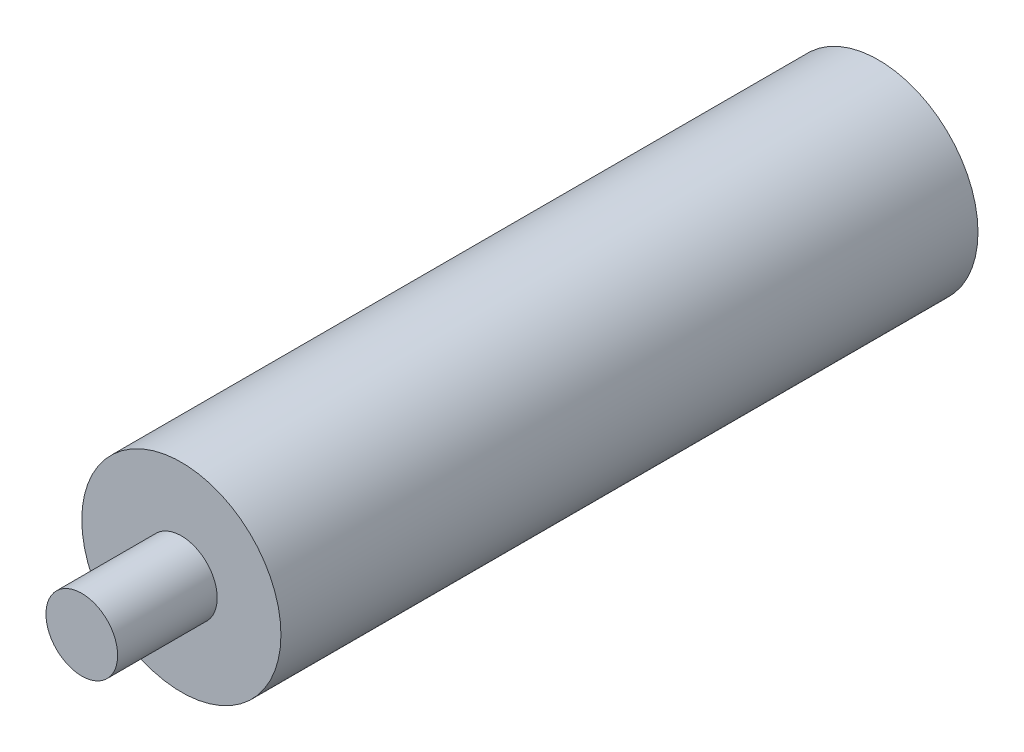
ISO-10303-21;
HEADER;
FILE_DESCRIPTION(('STEP AP214'),'2;1');
FILE_NAME('part.step','',(''),(''),'','','');
FILE_SCHEMA(('AUTOMOTIVE_DESIGN { 1 0 10303 214 1 1 1 1 }'));
ENDSEC;
DATA;
#1=APPLICATION_CONTEXT('core data for automotive mechanical design processes');
#2=APPLICATION_PROTOCOL_DEFINITION('international standard','automotive_design',2000,#1);
#3=PRODUCT_CONTEXT('',#1,'mechanical');
#4=PRODUCT('Part','Part','',(#3));
#5=PRODUCT_RELATED_PRODUCT_CATEGORY('part','',(#4));
#6=PRODUCT_DEFINITION_FORMATION('','',#4);
#7=PRODUCT_DEFINITION_CONTEXT('part definition',#1,'design');
#8=PRODUCT_DEFINITION('design','',#6,#7);
#9=PRODUCT_DEFINITION_SHAPE('','',#8);
#10=(LENGTH_UNIT() NAMED_UNIT(*) SI_UNIT(.MILLI.,.METRE.));
#11=(NAMED_UNIT(*) PLANE_ANGLE_UNIT() SI_UNIT($,.RADIAN.));
#12=(NAMED_UNIT(*) SI_UNIT($,.STERADIAN.) SOLID_ANGLE_UNIT());
#13=UNCERTAINTY_MEASURE_WITH_UNIT(LENGTH_MEASURE(1.E-05),#10,'distance_accuracy_value','');
#14=(GEOMETRIC_REPRESENTATION_CONTEXT(3) GLOBAL_UNCERTAINTY_ASSIGNED_CONTEXT((#13)) GLOBAL_UNIT_ASSIGNED_CONTEXT((#10,
#11,#12)) REPRESENTATION_CONTEXT('',''));
#15=CARTESIAN_POINT('',(0.,0.,0.));
#16=DIRECTION('',(0.,0.,1.));
#17=DIRECTION('',(1.,0.,0.));
#18=AXIS2_PLACEMENT_3D('',#15,#16,#17);
#19=CARTESIAN_POINT('',(0.,0.,25.4));
#20=DIRECTION('',(0.,0.,1.));
#21=DIRECTION('',(1.,0.,0.));
#22=AXIS2_PLACEMENT_3D('',#19,#20,#21);
#23=PLANE('',#22);
#24=CARTESIAN_POINT('',(0.,0.,25.4));
#25=DIRECTION('',(0.,0.,1.));
#26=DIRECTION('',(1.,0.,0.));
#27=AXIS2_PLACEMENT_3D('',#24,#25,#26);
#28=CIRCLE('',#27,1.143);
#29=CARTESIAN_POINT('',(1.143,0.,25.4));
#30=VERTEX_POINT('',#29);
#31=EDGE_CURVE('E18',#30,#30,#28,.F.);
#32=ORIENTED_EDGE('',*,*,#31,.F.);
#33=EDGE_LOOP('',(#32));
#34=FACE_BOUND('',#33,.T.);
#35=ADVANCED_FACE('F15',(#34),#23,.T.);
#36=CARTESIAN_POINT('',(0.,0.,22.225));
#37=DIRECTION('',(0.,0.,1.));
#38=DIRECTION('',(1.,0.,0.));
#39=AXIS2_PLACEMENT_3D('',#36,#37,#38);
#40=CYLINDRICAL_SURFACE('',#39,1.143);
#41=ORIENTED_EDGE('',*,*,#31,.T.);
#42=EDGE_LOOP('',(#41));
#43=FACE_BOUND('',#42,.T.);
#44=CARTESIAN_POINT('',(0.,0.,22.225));
#45=DIRECTION('',(0.,0.,1.));
#46=DIRECTION('',(1.,0.,0.));
#47=AXIS2_PLACEMENT_3D('',#44,#45,#46);
#48=CIRCLE('',#47,1.143);
#49=CARTESIAN_POINT('',(1.143,0.,22.225));
#50=VERTEX_POINT('',#49);
#51=EDGE_CURVE('E27',#50,#50,#48,.F.);
#52=ORIENTED_EDGE('',*,*,#51,.F.);
#53=EDGE_LOOP('',(#52));
#54=FACE_BOUND('',#53,.T.);
#55=ADVANCED_FACE('F35',(#43,#54),#40,.T.);
#56=CARTESIAN_POINT('',(0.,0.,22.225));
#57=DIRECTION('',(0.,0.,1.));
#58=DIRECTION('',(1.,0.,0.));
#59=AXIS2_PLACEMENT_3D('',#56,#57,#58);
#60=PLANE('',#59);
#61=ORIENTED_EDGE('',*,*,#51,.T.);
#62=EDGE_LOOP('',(#61));
#63=FACE_BOUND('',#62,.T.);
#64=CARTESIAN_POINT('',(0.,0.,22.225));
#65=DIRECTION('',(0.,0.,1.));
#66=DIRECTION('',(1.,0.,0.));
#67=AXIS2_PLACEMENT_3D('',#64,#65,#66);
#68=CIRCLE('',#67,3.175);
#69=CARTESIAN_POINT('',(3.175,0.,22.225));
#70=VERTEX_POINT('',#69);
#71=EDGE_CURVE('E22',#70,#70,#68,.F.);
#72=ORIENTED_EDGE('',*,*,#71,.F.);
#73=EDGE_LOOP('',(#72));
#74=FACE_BOUND('',#73,.T.);
#75=ADVANCED_FACE('F43',(#63,#74),#60,.T.);
#76=CARTESIAN_POINT('',(0.,0.,0.));
#77=DIRECTION('',(0.,0.,1.));
#78=DIRECTION('',(1.,0.,0.));
#79=AXIS2_PLACEMENT_3D('',#76,#77,#78);
#80=PLANE('',#79);
#81=CARTESIAN_POINT('',(0.,0.,0.));
#82=DIRECTION('',(0.,0.,1.));
#83=DIRECTION('',(1.,0.,0.));
#84=AXIS2_PLACEMENT_3D('',#81,#82,#83);
#85=CIRCLE('',#84,3.175);
#86=CARTESIAN_POINT('',(3.175,0.,0.));
#87=VERTEX_POINT('',#86);
#88=EDGE_CURVE('E10',#87,#87,#85,.T.);
#89=ORIENTED_EDGE('',*,*,#88,.F.);
#90=EDGE_LOOP('',(#89));
#91=FACE_BOUND('',#90,.T.);
#92=ADVANCED_FACE('F46',(#91),#80,.F.);
#93=CARTESIAN_POINT('',(0.,0.,0.));
#94=DIRECTION('',(0.,0.,1.));
#95=DIRECTION('',(1.,0.,0.));
#96=AXIS2_PLACEMENT_3D('',#93,#94,#95);
#97=CYLINDRICAL_SURFACE('',#96,3.175);
#98=ORIENTED_EDGE('',*,*,#71,.T.);
#99=EDGE_LOOP('',(#98));
#100=FACE_BOUND('',#99,.T.);
#101=ORIENTED_EDGE('',*,*,#88,.T.);
#102=EDGE_LOOP('',(#101));
#103=FACE_BOUND('',#102,.T.);
#104=ADVANCED_FACE('F44',(#100,#103),#97,.T.);
#105=CLOSED_SHELL('',(#35,#55,#75,#92,#104));
#106=MANIFOLD_SOLID_BREP('B1',#105);
#107=ADVANCED_BREP_SHAPE_REPRESENTATION('',(#18,#106),#14);
#108=SHAPE_DEFINITION_REPRESENTATION(#9,#107);
ENDSEC;
END-ISO-10303-21;
